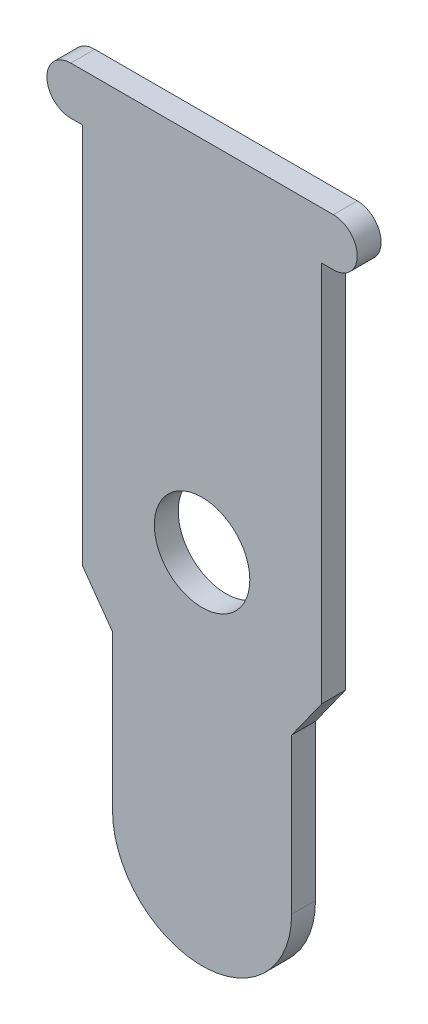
from build123d import *

# Parameters (mm, degrees)
SKETCH1_R           = 4
BOSS_EXTRUDE1_DEPTH = 2


with BuildPart() as part:
    # Sketch1 → Boss-Extrude1 (new body)
    with BuildSketch(Plane.XY):
        with BuildLine():
            Line((11, 26), (10, 26))
            Line((10, 26), (10, -6))
            Line((10, -6), (7.5, -9.5))
            Line((7.5, -9.5), (7.5, -22.5))
            ThreePointArc((7.5, -22.5), (0, -30), (-7.5, -22.5))
            Line((-7.5, -22.5), (-7.5, -9.5))
            Line((-7.5, -9.5), (-10, -6))
            Line((-10, -6), (-10, 26))
            Line((-10, 26), (-11, 26))
            ThreePointArc((-11, 26), (-13, 28), (-11, 30))
            Line((-11, 30), (11, 30))
            ThreePointArc((11, 30), (13, 28), (11, 26))
        make_face()
        Circle(SKETCH1_R, mode=Mode.SUBTRACT)
    extrude(amount=BOSS_EXTRUDE1_DEPTH)


solid = part.part
